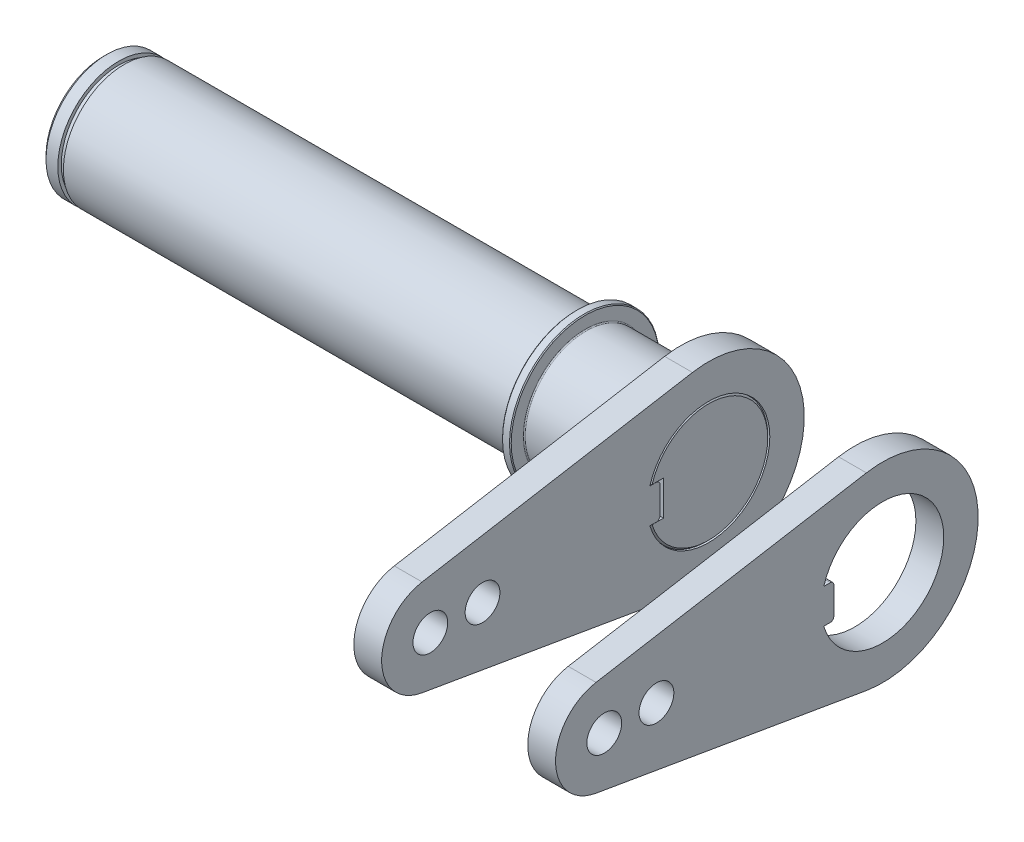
ISO-10303-21;
HEADER;
FILE_DESCRIPTION(('STEP AP214'),'2;1');
FILE_NAME('part.step','',(''),(''),'','','');
FILE_SCHEMA(('AUTOMOTIVE_DESIGN { 1 0 10303 214 1 1 1 1 }'));
ENDSEC;
DATA;
#1=APPLICATION_CONTEXT('core data for automotive mechanical design processes');
#2=APPLICATION_PROTOCOL_DEFINITION('international standard','automotive_design',2000,#1);
#3=PRODUCT_CONTEXT('',#1,'mechanical');
#4=PRODUCT('Part','Part','',(#3));
#5=PRODUCT_RELATED_PRODUCT_CATEGORY('part','',(#4));
#6=PRODUCT_DEFINITION_FORMATION('','',#4);
#7=PRODUCT_DEFINITION_CONTEXT('part definition',#1,'design');
#8=PRODUCT_DEFINITION('design','',#6,#7);
#9=PRODUCT_DEFINITION_SHAPE('','',#8);
#10=(LENGTH_UNIT() NAMED_UNIT(*) SI_UNIT(.MILLI.,.METRE.));
#11=(NAMED_UNIT(*) PLANE_ANGLE_UNIT() SI_UNIT($,.RADIAN.));
#12=(NAMED_UNIT(*) SI_UNIT($,.STERADIAN.) SOLID_ANGLE_UNIT());
#13=UNCERTAINTY_MEASURE_WITH_UNIT(LENGTH_MEASURE(1.E-05),#10,'distance_accuracy_value','');
#14=(GEOMETRIC_REPRESENTATION_CONTEXT(3) GLOBAL_UNCERTAINTY_ASSIGNED_CONTEXT((#13)) GLOBAL_UNIT_ASSIGNED_CONTEXT((#10,
#11,#12)) REPRESENTATION_CONTEXT('',''));
#15=CARTESIAN_POINT('',(0.,0.,0.));
#16=DIRECTION('',(0.,0.,1.));
#17=DIRECTION('',(1.,0.,0.));
#18=AXIS2_PLACEMENT_3D('',#15,#16,#17);
#19=CARTESIAN_POINT('',(76.5,0.,0.));
#20=DIRECTION('',(1.,0.,0.));
#21=DIRECTION('',(0.,1.,0.));
#22=AXIS2_PLACEMENT_3D('',#19,#20,#21);
#23=CYLINDRICAL_SURFACE('',#22,27.5);
#24=CARTESIAN_POINT('',(84.5,0.,0.));
#25=DIRECTION('',(1.,0.,0.));
#26=DIRECTION('',(0.,1.,0.));
#27=AXIS2_PLACEMENT_3D('',#24,#25,#26);
#28=CIRCLE('',#27,27.5);
#29=CARTESIAN_POINT('',(84.5,-27.1056193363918,4.640625));
#30=VERTEX_POINT('',#29);
#31=CARTESIAN_POINT('',(84.5,27.1056193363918,4.640625));
#32=VERTEX_POINT('',#31);
#33=EDGE_CURVE('E171',#30,#32,#28,.T.);
#34=ORIENTED_EDGE('',*,*,#33,.F.);
#35=DIRECTION('',(1.,0.,0.));
#36=VECTOR('',#35,1.);
#37=CARTESIAN_POINT('',(76.5,-27.1056193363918,4.640625));
#38=LINE('',#37,#36);
#39=CARTESIAN_POINT('',(76.5,-27.1056193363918,4.640625));
#40=VERTEX_POINT('',#39);
#41=EDGE_CURVE('E12',#40,#30,#38,.T.);
#42=ORIENTED_EDGE('',*,*,#41,.F.);
#43=CARTESIAN_POINT('',(76.5,0.,0.));
#44=DIRECTION('',(1.,0.,0.));
#45=DIRECTION('',(0.,1.,0.));
#46=AXIS2_PLACEMENT_3D('',#43,#44,#45);
#47=CIRCLE('',#46,27.5);
#48=CARTESIAN_POINT('',(76.5,27.1056193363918,4.640625));
#49=VERTEX_POINT('',#48);
#50=EDGE_CURVE('E179',#40,#49,#47,.T.);
#51=ORIENTED_EDGE('',*,*,#50,.T.);
#52=DIRECTION('',(1.,0.,0.));
#53=VECTOR('',#52,1.);
#54=CARTESIAN_POINT('',(76.5,27.1056193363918,4.640625));
#55=LINE('',#54,#53);
#56=EDGE_CURVE('E48',#49,#32,#55,.T.);
#57=ORIENTED_EDGE('',*,*,#56,.T.);
#58=EDGE_LOOP('',(#34,#42,#51,#57));
#59=FACE_BOUND('',#58,.T.);
#60=ADVANCED_FACE('F45',(#59),#23,.T.);
#61=CARTESIAN_POINT('',(76.5,-13.7992243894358,82.3625));
#62=DIRECTION('',(0.,-0.985658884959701,0.16875));
#63=DIRECTION('',(0.,-0.16875,-0.985658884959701));
#64=AXIS2_PLACEMENT_3D('',#61,#62,#63);
#65=PLANE('',#64);
#66=DIRECTION('',(0.,-0.16875,-0.9856588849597));
#67=VECTOR('',#66,1.);
#68=CARTESIAN_POINT('',(84.5,-13.7992243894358,82.3625));
#69=LINE('',#68,#67);
#70=CARTESIAN_POINT('',(84.5,-13.7992243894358,82.3625));
#71=VERTEX_POINT('',#70);
#72=EDGE_CURVE('E183',#71,#30,#69,.T.);
#73=ORIENTED_EDGE('',*,*,#72,.F.);
#74=DIRECTION('',(1.,0.,0.));
#75=VECTOR('',#74,1.);
#76=CARTESIAN_POINT('',(76.5,-13.7992243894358,82.3625));
#77=LINE('',#76,#75);
#78=CARTESIAN_POINT('',(76.5,-13.7992243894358,82.3625));
#79=VERTEX_POINT('',#78);
#80=EDGE_CURVE('E53',#79,#71,#77,.T.);
#81=ORIENTED_EDGE('',*,*,#80,.F.);
#82=DIRECTION('',(0.,-0.16875,-0.9856588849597));
#83=VECTOR('',#82,1.);
#84=CARTESIAN_POINT('',(76.5,-13.7992243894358,82.3625));
#85=LINE('',#84,#83);
#86=EDGE_CURVE('E189',#79,#40,#85,.T.);
#87=ORIENTED_EDGE('',*,*,#86,.T.);
#88=ORIENTED_EDGE('',*,*,#41,.T.);
#89=EDGE_LOOP('',(#73,#81,#87,#88));
#90=FACE_BOUND('',#89,.T.);
#91=ADVANCED_FACE('F215',(#90),#65,.T.);
#92=CARTESIAN_POINT('',(76.5,0.,80.));
#93=DIRECTION('',(1.,0.,0.));
#94=DIRECTION('',(0.,1.,0.));
#95=AXIS2_PLACEMENT_3D('',#92,#93,#94);
#96=CYLINDRICAL_SURFACE('',#95,14.);
#97=CARTESIAN_POINT('',(84.5,0.,80.));
#98=DIRECTION('',(1.,0.,0.));
#99=DIRECTION('',(0.,1.,0.));
#100=AXIS2_PLACEMENT_3D('',#97,#98,#99);
#101=CIRCLE('',#100,14.);
#102=CARTESIAN_POINT('',(84.5,13.7992243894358,82.3625));
#103=VERTEX_POINT('',#102);
#104=EDGE_CURVE('E197',#103,#71,#101,.T.);
#105=ORIENTED_EDGE('',*,*,#104,.F.);
#106=DIRECTION('',(1.,0.,0.));
#107=VECTOR('',#106,1.);
#108=CARTESIAN_POINT('',(76.5,13.7992243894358,82.3625));
#109=LINE('',#108,#107);
#110=CARTESIAN_POINT('',(76.5,13.7992243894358,82.3625));
#111=VERTEX_POINT('',#110);
#112=EDGE_CURVE('E202',#111,#103,#109,.T.);
#113=ORIENTED_EDGE('',*,*,#112,.F.);
#114=CARTESIAN_POINT('',(76.5,0.,80.));
#115=DIRECTION('',(1.,0.,0.));
#116=DIRECTION('',(0.,1.,0.));
#117=AXIS2_PLACEMENT_3D('',#114,#115,#116);
#118=CIRCLE('',#117,14.);
#119=EDGE_CURVE('E186',#111,#79,#118,.T.);
#120=ORIENTED_EDGE('',*,*,#119,.T.);
#121=ORIENTED_EDGE('',*,*,#80,.T.);
#122=EDGE_LOOP('',(#105,#113,#120,#121));
#123=FACE_BOUND('',#122,.T.);
#124=ADVANCED_FACE('F219',(#123),#96,.T.);
#125=CARTESIAN_POINT('',(76.5,27.1056193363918,4.640625));
#126=DIRECTION('',(0.,0.985658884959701,0.16875));
#127=DIRECTION('',(0.,-0.16875,0.985658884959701));
#128=AXIS2_PLACEMENT_3D('',#125,#126,#127);
#129=PLANE('',#128);
#130=DIRECTION('',(0.,-0.16875,0.9856588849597));
#131=VECTOR('',#130,1.);
#132=CARTESIAN_POINT('',(84.5,27.1056193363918,4.640625));
#133=LINE('',#132,#131);
#134=EDGE_CURVE('E194',#32,#103,#133,.T.);
#135=ORIENTED_EDGE('',*,*,#134,.F.);
#136=ORIENTED_EDGE('',*,*,#56,.F.);
#137=DIRECTION('',(0.,-0.16875,0.9856588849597));
#138=VECTOR('',#137,1.);
#139=CARTESIAN_POINT('',(76.5,27.1056193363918,4.640625));
#140=LINE('',#139,#138);
#141=EDGE_CURVE('E182',#49,#111,#140,.T.);
#142=ORIENTED_EDGE('',*,*,#141,.T.);
#143=ORIENTED_EDGE('',*,*,#112,.T.);
#144=EDGE_LOOP('',(#135,#136,#142,#143));
#145=FACE_BOUND('',#144,.T.);
#146=ADVANCED_FACE('F210',(#145),#129,.T.);
#147=CARTESIAN_POINT('',(76.5,0.,0.));
#148=DIRECTION('',(1.,0.,0.));
#149=DIRECTION('',(0.,1.,0.));
#150=AXIS2_PLACEMENT_3D('',#147,#148,#149);
#151=PLANE('',#150);
#152=CARTESIAN_POINT('',(76.5,0.,65.));
#153=DIRECTION('',(1.,0.,0.));
#154=DIRECTION('',(0.,1.,0.));
#155=AXIS2_PLACEMENT_3D('',#152,#153,#154);
#156=CIRCLE('',#155,5.);
#157=CARTESIAN_POINT('',(76.5,5.,65.));
#158=VERTEX_POINT('',#157);
#159=EDGE_CURVE('E344',#158,#158,#156,.T.);
#160=ORIENTED_EDGE('',*,*,#159,.T.);
#161=EDGE_LOOP('',(#160));
#162=FACE_BOUND('',#161,.T.);
#163=CARTESIAN_POINT('',(76.5,0.,80.));
#164=DIRECTION('',(1.,0.,0.));
#165=DIRECTION('',(0.,1.,0.));
#166=AXIS2_PLACEMENT_3D('',#163,#164,#165);
#167=CIRCLE('',#166,5.);
#168=CARTESIAN_POINT('',(76.5,5.,80.));
#169=VERTEX_POINT('',#168);
#170=EDGE_CURVE('E159',#169,#169,#167,.T.);
#171=ORIENTED_EDGE('',*,*,#170,.T.);
#172=EDGE_LOOP('',(#171));
#173=FACE_BOUND('',#172,.T.);
#174=DIRECTION('',(0.,-1.,0.));
#175=VECTOR('',#174,1.);
#176=CARTESIAN_POINT('',(76.5,3.95,14.));
#177=LINE('',#176,#175);
#178=CARTESIAN_POINT('',(76.5,3.95,14.));
#179=VERTEX_POINT('',#178);
#180=CARTESIAN_POINT('',(76.5,-3.95,14.));
#181=VERTEX_POINT('',#180);
#182=EDGE_CURVE('E130',#179,#181,#177,.T.);
#183=ORIENTED_EDGE('',*,*,#182,.T.);
#184=CARTESIAN_POINT('',(76.5,-3.95,15.));
#185=DIRECTION('',(-1.,0.,0.));
#186=DIRECTION('',(0.,-1.,0.));
#187=AXIS2_PLACEMENT_3D('',#184,#185,#186);
#188=CIRCLE('',#187,1.);
#189=CARTESIAN_POINT('',(76.5,-4.95,15.));
#190=VERTEX_POINT('',#189);
#191=EDGE_CURVE('E124',#181,#190,#188,.T.);
#192=ORIENTED_EDGE('',*,*,#191,.T.);
#193=DIRECTION('',(0.,0.,1.));
#194=VECTOR('',#193,1.);
#195=CARTESIAN_POINT('',(76.5,-4.95,15.));
#196=LINE('',#195,#194);
#197=CARTESIAN_POINT('',(76.5,-4.95,16.8895677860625));
#198=VERTEX_POINT('',#197);
#199=EDGE_CURVE('E133',#190,#198,#196,.T.);
#200=ORIENTED_EDGE('',*,*,#199,.T.);
#201=CARTESIAN_POINT('',(76.5,0.,0.));
#202=DIRECTION('',(1.,0.,0.));
#203=DIRECTION('',(0.,1.,0.));
#204=AXIS2_PLACEMENT_3D('',#201,#202,#203);
#205=CIRCLE('',#204,17.6);
#206=CARTESIAN_POINT('',(76.5,4.95,16.8895677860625));
#207=VERTEX_POINT('',#206);
#208=EDGE_CURVE('E61',#198,#207,#205,.T.);
#209=ORIENTED_EDGE('',*,*,#208,.T.);
#210=DIRECTION('',(0.,0.,-1.));
#211=VECTOR('',#210,1.);
#212=CARTESIAN_POINT('',(76.5,4.95,16.8895677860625));
#213=LINE('',#212,#211);
#214=CARTESIAN_POINT('',(76.5,4.95,15.));
#215=VERTEX_POINT('',#214);
#216=EDGE_CURVE('E151',#207,#215,#213,.T.);
#217=ORIENTED_EDGE('',*,*,#216,.T.);
#218=CARTESIAN_POINT('',(76.5,3.95,15.));
#219=DIRECTION('',(-1.,0.,0.));
#220=DIRECTION('',(0.,-1.,0.));
#221=AXIS2_PLACEMENT_3D('',#218,#219,#220);
#222=CIRCLE('',#221,1.);
#223=EDGE_CURVE('E154',#215,#179,#222,.T.);
#224=ORIENTED_EDGE('',*,*,#223,.T.);
#225=EDGE_LOOP('',(#183,#192,#200,#209,#217,#224));
#226=FACE_BOUND('',#225,.T.);
#227=ORIENTED_EDGE('',*,*,#50,.F.);
#228=ORIENTED_EDGE('',*,*,#86,.F.);
#229=ORIENTED_EDGE('',*,*,#119,.F.);
#230=ORIENTED_EDGE('',*,*,#141,.F.);
#231=EDGE_LOOP('',(#227,#228,#229,#230));
#232=FACE_BOUND('',#231,.T.);
#233=ADVANCED_FACE('F137',(#162,#173,#226,#232),#151,.F.);
#234=CARTESIAN_POINT('',(84.5,0.,0.));
#235=DIRECTION('',(1.,0.,0.));
#236=DIRECTION('',(0.,1.,0.));
#237=AXIS2_PLACEMENT_3D('',#234,#235,#236);
#238=PLANE('',#237);
#239=CARTESIAN_POINT('',(84.5,0.,65.));
#240=DIRECTION('',(1.,0.,0.));
#241=DIRECTION('',(0.,1.,0.));
#242=AXIS2_PLACEMENT_3D('',#239,#240,#241);
#243=CIRCLE('',#242,5.);
#244=CARTESIAN_POINT('',(84.5,5.,65.));
#245=VERTEX_POINT('',#244);
#246=EDGE_CURVE('E347',#245,#245,#243,.T.);
#247=ORIENTED_EDGE('',*,*,#246,.F.);
#248=EDGE_LOOP('',(#247));
#249=FACE_BOUND('',#248,.T.);
#250=CARTESIAN_POINT('',(84.5,0.,80.));
#251=DIRECTION('',(1.,0.,0.));
#252=DIRECTION('',(0.,1.,0.));
#253=AXIS2_PLACEMENT_3D('',#250,#251,#252);
#254=CIRCLE('',#253,5.);
#255=CARTESIAN_POINT('',(84.5,5.,80.));
#256=VERTEX_POINT('',#255);
#257=EDGE_CURVE('E147',#256,#256,#254,.T.);
#258=ORIENTED_EDGE('',*,*,#257,.F.);
#259=EDGE_LOOP('',(#258));
#260=FACE_BOUND('',#259,.T.);
#261=CARTESIAN_POINT('',(84.5,-3.95,15.));
#262=DIRECTION('',(-1.,0.,0.));
#263=DIRECTION('',(0.,-1.,0.));
#264=AXIS2_PLACEMENT_3D('',#261,#262,#263);
#265=CIRCLE('',#264,1.);
#266=CARTESIAN_POINT('',(84.5,-3.95,14.));
#267=VERTEX_POINT('',#266);
#268=CARTESIAN_POINT('',(84.5,-4.95,15.));
#269=VERTEX_POINT('',#268);
#270=EDGE_CURVE('E69',#267,#269,#265,.T.);
#271=ORIENTED_EDGE('',*,*,#270,.F.);
#272=DIRECTION('',(0.,-1.,0.));
#273=VECTOR('',#272,1.);
#274=CARTESIAN_POINT('',(84.5,3.95,14.));
#275=LINE('',#274,#273);
#276=CARTESIAN_POINT('',(84.5,3.95,14.));
#277=VERTEX_POINT('',#276);
#278=EDGE_CURVE('E141',#277,#267,#275,.T.);
#279=ORIENTED_EDGE('',*,*,#278,.F.);
#280=CARTESIAN_POINT('',(84.5,3.95,15.));
#281=DIRECTION('',(-1.,0.,0.));
#282=DIRECTION('',(0.,-1.,0.));
#283=AXIS2_PLACEMENT_3D('',#280,#281,#282);
#284=CIRCLE('',#283,1.);
#285=CARTESIAN_POINT('',(84.5,4.95,15.));
#286=VERTEX_POINT('',#285);
#287=EDGE_CURVE('E144',#286,#277,#284,.T.);
#288=ORIENTED_EDGE('',*,*,#287,.F.);
#289=DIRECTION('',(0.,0.,-1.));
#290=VECTOR('',#289,1.);
#291=CARTESIAN_POINT('',(84.5,4.95,16.8895677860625));
#292=LINE('',#291,#290);
#293=CARTESIAN_POINT('',(84.5,4.95,16.8895677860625));
#294=VERTEX_POINT('',#293);
#295=EDGE_CURVE('E164',#294,#286,#292,.T.);
#296=ORIENTED_EDGE('',*,*,#295,.F.);
#297=CARTESIAN_POINT('',(84.5,0.,0.));
#298=DIRECTION('',(1.,0.,0.));
#299=DIRECTION('',(0.,1.,0.));
#300=AXIS2_PLACEMENT_3D('',#297,#298,#299);
#301=CIRCLE('',#300,17.6);
#302=CARTESIAN_POINT('',(84.5,-4.95,16.8895677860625));
#303=VERTEX_POINT('',#302);
#304=EDGE_CURVE('E161',#303,#294,#301,.T.);
#305=ORIENTED_EDGE('',*,*,#304,.F.);
#306=DIRECTION('',(0.,0.,1.));
#307=VECTOR('',#306,1.);
#308=CARTESIAN_POINT('',(84.5,-4.95,15.));
#309=LINE('',#308,#307);
#310=EDGE_CURVE('E158',#269,#303,#309,.T.);
#311=ORIENTED_EDGE('',*,*,#310,.F.);
#312=EDGE_LOOP('',(#271,#279,#288,#296,#305,#311));
#313=FACE_BOUND('',#312,.T.);
#314=ORIENTED_EDGE('',*,*,#33,.T.);
#315=ORIENTED_EDGE('',*,*,#134,.T.);
#316=ORIENTED_EDGE('',*,*,#104,.T.);
#317=ORIENTED_EDGE('',*,*,#72,.T.);
#318=EDGE_LOOP('',(#314,#315,#316,#317));
#319=FACE_BOUND('',#318,.T.);
#320=ADVANCED_FACE('F212',(#249,#260,#313,#319),#238,.T.);
#321=CARTESIAN_POINT('',(76.5,-3.95,15.));
#322=DIRECTION('',(1.,0.,0.));
#323=DIRECTION('',(0.,1.,0.));
#324=AXIS2_PLACEMENT_3D('',#321,#322,#323);
#325=CYLINDRICAL_SURFACE('',#324,1.);
#326=ORIENTED_EDGE('',*,*,#270,.T.);
#327=DIRECTION('',(1.,0.,0.));
#328=VECTOR('',#327,1.);
#329=CARTESIAN_POINT('',(76.5,-4.95,15.));
#330=LINE('',#329,#328);
#331=EDGE_CURVE('E120',#190,#269,#330,.T.);
#332=ORIENTED_EDGE('',*,*,#331,.F.);
#333=ORIENTED_EDGE('',*,*,#191,.F.);
#334=DIRECTION('',(1.,0.,0.));
#335=VECTOR('',#334,1.);
#336=CARTESIAN_POINT('',(76.5,-3.95,14.));
#337=LINE('',#336,#335);
#338=EDGE_CURVE('E169',#181,#267,#337,.T.);
#339=ORIENTED_EDGE('',*,*,#338,.T.);
#340=EDGE_LOOP('',(#326,#332,#333,#339));
#341=FACE_BOUND('',#340,.T.);
#342=ADVANCED_FACE('F122',(#341),#325,.T.);
#343=CARTESIAN_POINT('',(76.5,3.95,14.));
#344=DIRECTION('',(0.,0.,1.));
#345=DIRECTION('',(1.,0.,0.));
#346=AXIS2_PLACEMENT_3D('',#343,#344,#345);
#347=PLANE('',#346);
#348=ORIENTED_EDGE('',*,*,#278,.T.);
#349=ORIENTED_EDGE('',*,*,#338,.F.);
#350=ORIENTED_EDGE('',*,*,#182,.F.);
#351=DIRECTION('',(1.,0.,0.));
#352=VECTOR('',#351,1.);
#353=CARTESIAN_POINT('',(76.5,3.95,14.));
#354=LINE('',#353,#352);
#355=EDGE_CURVE('E172',#179,#277,#354,.T.);
#356=ORIENTED_EDGE('',*,*,#355,.T.);
#357=EDGE_LOOP('',(#348,#349,#350,#356));
#358=FACE_BOUND('',#357,.T.);
#359=ADVANCED_FACE('F271',(#358),#347,.F.);
#360=CARTESIAN_POINT('',(76.5,3.95,15.));
#361=DIRECTION('',(1.,0.,0.));
#362=DIRECTION('',(0.,1.,0.));
#363=AXIS2_PLACEMENT_3D('',#360,#361,#362);
#364=CYLINDRICAL_SURFACE('',#363,1.);
#365=ORIENTED_EDGE('',*,*,#287,.T.);
#366=ORIENTED_EDGE('',*,*,#355,.F.);
#367=ORIENTED_EDGE('',*,*,#223,.F.);
#368=DIRECTION('',(1.,0.,0.));
#369=VECTOR('',#368,1.);
#370=CARTESIAN_POINT('',(76.5,4.95,15.));
#371=LINE('',#370,#369);
#372=EDGE_CURVE('E174',#215,#286,#371,.T.);
#373=ORIENTED_EDGE('',*,*,#372,.T.);
#374=EDGE_LOOP('',(#365,#366,#367,#373));
#375=FACE_BOUND('',#374,.T.);
#376=ADVANCED_FACE('F280',(#375),#364,.T.);
#377=CARTESIAN_POINT('',(76.5,4.95,16.8895677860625));
#378=DIRECTION('',(0.,-1.,0.));
#379=DIRECTION('',(1.,0.,0.));
#380=AXIS2_PLACEMENT_3D('',#377,#378,#379);
#381=PLANE('',#380);
#382=ORIENTED_EDGE('',*,*,#295,.T.);
#383=ORIENTED_EDGE('',*,*,#372,.F.);
#384=ORIENTED_EDGE('',*,*,#216,.F.);
#385=DIRECTION('',(1.,0.,0.));
#386=VECTOR('',#385,1.);
#387=CARTESIAN_POINT('',(76.5,4.95,16.8895677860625));
#388=LINE('',#387,#386);
#389=EDGE_CURVE('E176',#207,#294,#388,.T.);
#390=ORIENTED_EDGE('',*,*,#389,.T.);
#391=EDGE_LOOP('',(#382,#383,#384,#390));
#392=FACE_BOUND('',#391,.T.);
#393=ADVANCED_FACE('F290',(#392),#381,.F.);
#394=CARTESIAN_POINT('',(76.5,0.,0.));
#395=DIRECTION('',(1.,0.,0.));
#396=DIRECTION('',(0.,1.,0.));
#397=AXIS2_PLACEMENT_3D('',#394,#395,#396);
#398=CYLINDRICAL_SURFACE('',#397,17.6);
#399=ORIENTED_EDGE('',*,*,#304,.T.);
#400=ORIENTED_EDGE('',*,*,#389,.F.);
#401=ORIENTED_EDGE('',*,*,#208,.F.);
#402=DIRECTION('',(1.,0.,0.));
#403=VECTOR('',#402,1.);
#404=CARTESIAN_POINT('',(76.5,-4.95,16.8895677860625));
#405=LINE('',#404,#403);
#406=EDGE_CURVE('E129',#198,#303,#405,.T.);
#407=ORIENTED_EDGE('',*,*,#406,.T.);
#408=EDGE_LOOP('',(#399,#400,#401,#407));
#409=FACE_BOUND('',#408,.T.);
#410=ADVANCED_FACE('F300',(#409),#398,.F.);
#411=CARTESIAN_POINT('',(76.5,-4.95,15.));
#412=DIRECTION('',(0.,1.,0.));
#413=DIRECTION('',(-1.,0.,0.));
#414=AXIS2_PLACEMENT_3D('',#411,#412,#413);
#415=PLANE('',#414);
#416=ORIENTED_EDGE('',*,*,#310,.T.);
#417=ORIENTED_EDGE('',*,*,#406,.F.);
#418=ORIENTED_EDGE('',*,*,#199,.F.);
#419=ORIENTED_EDGE('',*,*,#331,.T.);
#420=EDGE_LOOP('',(#416,#417,#418,#419));
#421=FACE_BOUND('',#420,.T.);
#422=ADVANCED_FACE('F134',(#421),#415,.F.);
#423=CARTESIAN_POINT('',(76.5,0.,80.));
#424=DIRECTION('',(1.,0.,0.));
#425=DIRECTION('',(0.,1.,0.));
#426=AXIS2_PLACEMENT_3D('',#423,#424,#425);
#427=CYLINDRICAL_SURFACE('',#426,5.);
#428=ORIENTED_EDGE('',*,*,#170,.F.);
#429=EDGE_LOOP('',(#428));
#430=FACE_BOUND('',#429,.T.);
#431=ORIENTED_EDGE('',*,*,#257,.T.);
#432=EDGE_LOOP('',(#431));
#433=FACE_BOUND('',#432,.T.);
#434=ADVANCED_FACE('F318',(#430,#433),#427,.F.);
#435=CARTESIAN_POINT('',(76.5,0.,65.));
#436=DIRECTION('',(1.,0.,0.));
#437=DIRECTION('',(0.,1.,0.));
#438=AXIS2_PLACEMENT_3D('',#435,#436,#437);
#439=CYLINDRICAL_SURFACE('',#438,5.);
#440=ORIENTED_EDGE('',*,*,#159,.F.);
#441=EDGE_LOOP('',(#440));
#442=FACE_BOUND('',#441,.T.);
#443=ORIENTED_EDGE('',*,*,#246,.T.);
#444=EDGE_LOOP('',(#443));
#445=FACE_BOUND('',#444,.T.);
#446=ADVANCED_FACE('F327',(#442,#445),#439,.F.);
#447=CLOSED_SHELL('',(#60,#91,#124,#146,#233,#320,#342,#359,#376,#393,#410,#422,#434,#446));
#448=MANIFOLD_SOLID_BREP('B2_NOT_SHOWN',#447);
#449=CARTESIAN_POINT('',(26.5,0.,0.));
#450=DIRECTION('',(1.,0.,0.));
#451=DIRECTION('',(0.,1.,0.));
#452=AXIS2_PLACEMENT_3D('',#449,#450,#451);
#453=CYLINDRICAL_SURFACE('',#452,27.5);
#454=CARTESIAN_POINT('',(34.5,0.,0.));
#455=DIRECTION('',(1.,0.,0.));
#456=DIRECTION('',(0.,1.,0.));
#457=AXIS2_PLACEMENT_3D('',#454,#455,#456);
#458=CIRCLE('',#457,27.5);
#459=CARTESIAN_POINT('',(34.5,-27.1056193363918,4.640625));
#460=VERTEX_POINT('',#459);
#461=CARTESIAN_POINT('',(34.5,27.1056193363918,4.640625));
#462=VERTEX_POINT('',#461);
#463=EDGE_CURVE('E503',#460,#462,#458,.T.);
#464=ORIENTED_EDGE('',*,*,#463,.F.);
#465=DIRECTION('',(1.,0.,0.));
#466=VECTOR('',#465,1.);
#467=CARTESIAN_POINT('',(26.5,-27.1056193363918,4.640625));
#468=LINE('',#467,#466);
#469=CARTESIAN_POINT('',(26.5,-27.1056193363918,4.640625));
#470=VERTEX_POINT('',#469);
#471=EDGE_CURVE('E43',#470,#460,#468,.T.);
#472=ORIENTED_EDGE('',*,*,#471,.F.);
#473=CARTESIAN_POINT('',(26.5,0.,0.));
#474=DIRECTION('',(1.,0.,0.));
#475=DIRECTION('',(0.,1.,0.));
#476=AXIS2_PLACEMENT_3D('',#473,#474,#475);
#477=CIRCLE('',#476,27.5);
#478=CARTESIAN_POINT('',(26.5,27.1056193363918,4.640625));
#479=VERTEX_POINT('',#478);
#480=EDGE_CURVE('E511',#470,#479,#477,.T.);
#481=ORIENTED_EDGE('',*,*,#480,.T.);
#482=DIRECTION('',(1.,0.,0.));
#483=VECTOR('',#482,1.);
#484=CARTESIAN_POINT('',(26.5,27.1056193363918,4.640625));
#485=LINE('',#484,#483);
#486=EDGE_CURVE('E380',#479,#462,#485,.T.);
#487=ORIENTED_EDGE('',*,*,#486,.T.);
#488=EDGE_LOOP('',(#464,#472,#481,#487));
#489=FACE_BOUND('',#488,.T.);
#490=ADVANCED_FACE('F377',(#489),#453,.T.);
#491=CARTESIAN_POINT('',(26.5,-13.7992243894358,82.3625));
#492=DIRECTION('',(0.,-0.985658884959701,0.16875));
#493=DIRECTION('',(0.,-0.16875,-0.985658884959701));
#494=AXIS2_PLACEMENT_3D('',#491,#492,#493);
#495=PLANE('',#494);
#496=DIRECTION('',(0.,-0.16875,-0.9856588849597));
#497=VECTOR('',#496,1.);
#498=CARTESIAN_POINT('',(34.5,-13.7992243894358,82.3625));
#499=LINE('',#498,#497);
#500=CARTESIAN_POINT('',(34.5,-13.7992243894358,82.3625));
#501=VERTEX_POINT('',#500);
#502=EDGE_CURVE('E515',#501,#460,#499,.T.);
#503=ORIENTED_EDGE('',*,*,#502,.F.);
#504=DIRECTION('',(1.,0.,0.));
#505=VECTOR('',#504,1.);
#506=CARTESIAN_POINT('',(26.5,-13.7992243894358,82.3625));
#507=LINE('',#506,#505);
#508=CARTESIAN_POINT('',(26.5,-13.7992243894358,82.3625));
#509=VERTEX_POINT('',#508);
#510=EDGE_CURVE('E385',#509,#501,#507,.T.);
#511=ORIENTED_EDGE('',*,*,#510,.F.);
#512=DIRECTION('',(0.,-0.16875,-0.9856588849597));
#513=VECTOR('',#512,1.);
#514=CARTESIAN_POINT('',(26.5,-13.7992243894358,82.3625));
#515=LINE('',#514,#513);
#516=EDGE_CURVE('E521',#509,#470,#515,.T.);
#517=ORIENTED_EDGE('',*,*,#516,.T.);
#518=ORIENTED_EDGE('',*,*,#471,.T.);
#519=EDGE_LOOP('',(#503,#511,#517,#518));
#520=FACE_BOUND('',#519,.T.);
#521=ADVANCED_FACE('F547',(#520),#495,.T.);
#522=CARTESIAN_POINT('',(26.5,0.,80.));
#523=DIRECTION('',(1.,0.,0.));
#524=DIRECTION('',(0.,1.,0.));
#525=AXIS2_PLACEMENT_3D('',#522,#523,#524);
#526=CYLINDRICAL_SURFACE('',#525,14.);
#527=CARTESIAN_POINT('',(34.5,0.,80.));
#528=DIRECTION('',(1.,0.,0.));
#529=DIRECTION('',(0.,1.,0.));
#530=AXIS2_PLACEMENT_3D('',#527,#528,#529);
#531=CIRCLE('',#530,14.);
#532=CARTESIAN_POINT('',(34.5,13.7992243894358,82.3625));
#533=VERTEX_POINT('',#532);
#534=EDGE_CURVE('E529',#533,#501,#531,.T.);
#535=ORIENTED_EDGE('',*,*,#534,.F.);
#536=DIRECTION('',(1.,0.,0.));
#537=VECTOR('',#536,1.);
#538=CARTESIAN_POINT('',(26.5,13.7992243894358,82.3625));
#539=LINE('',#538,#537);
#540=CARTESIAN_POINT('',(26.5,13.7992243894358,82.3625));
#541=VERTEX_POINT('',#540);
#542=EDGE_CURVE('E534',#541,#533,#539,.T.);
#543=ORIENTED_EDGE('',*,*,#542,.F.);
#544=CARTESIAN_POINT('',(26.5,0.,80.));
#545=DIRECTION('',(1.,0.,0.));
#546=DIRECTION('',(0.,1.,0.));
#547=AXIS2_PLACEMENT_3D('',#544,#545,#546);
#548=CIRCLE('',#547,14.);
#549=EDGE_CURVE('E518',#541,#509,#548,.T.);
#550=ORIENTED_EDGE('',*,*,#549,.T.);
#551=ORIENTED_EDGE('',*,*,#510,.T.);
#552=EDGE_LOOP('',(#535,#543,#550,#551));
#553=FACE_BOUND('',#552,.T.);
#554=ADVANCED_FACE('F551',(#553),#526,.T.);
#555=CARTESIAN_POINT('',(26.5,27.1056193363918,4.640625));
#556=DIRECTION('',(0.,0.985658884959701,0.16875));
#557=DIRECTION('',(0.,-0.16875,0.985658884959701));
#558=AXIS2_PLACEMENT_3D('',#555,#556,#557);
#559=PLANE('',#558);
#560=DIRECTION('',(0.,-0.16875,0.9856588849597));
#561=VECTOR('',#560,1.);
#562=CARTESIAN_POINT('',(34.5,27.1056193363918,4.640625));
#563=LINE('',#562,#561);
#564=EDGE_CURVE('E526',#462,#533,#563,.T.);
#565=ORIENTED_EDGE('',*,*,#564,.F.);
#566=ORIENTED_EDGE('',*,*,#486,.F.);
#567=DIRECTION('',(0.,-0.16875,0.9856588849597));
#568=VECTOR('',#567,1.);
#569=CARTESIAN_POINT('',(26.5,27.1056193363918,4.640625));
#570=LINE('',#569,#568);
#571=EDGE_CURVE('E514',#479,#541,#570,.T.);
#572=ORIENTED_EDGE('',*,*,#571,.T.);
#573=ORIENTED_EDGE('',*,*,#542,.T.);
#574=EDGE_LOOP('',(#565,#566,#572,#573));
#575=FACE_BOUND('',#574,.T.);
#576=ADVANCED_FACE('F542',(#575),#559,.T.);
#577=CARTESIAN_POINT('',(26.5,0.,0.));
#578=DIRECTION('',(1.,0.,0.));
#579=DIRECTION('',(0.,1.,0.));
#580=AXIS2_PLACEMENT_3D('',#577,#578,#579);
#581=PLANE('',#580);
#582=CARTESIAN_POINT('',(26.5,0.,65.));
#583=DIRECTION('',(1.,0.,0.));
#584=DIRECTION('',(0.,1.,0.));
#585=AXIS2_PLACEMENT_3D('',#582,#583,#584);
#586=CIRCLE('',#585,5.);
#587=CARTESIAN_POINT('',(26.5,5.,65.));
#588=VERTEX_POINT('',#587);
#589=EDGE_CURVE('E701',#588,#588,#586,.T.);
#590=ORIENTED_EDGE('',*,*,#589,.T.);
#591=EDGE_LOOP('',(#590));
#592=FACE_BOUND('',#591,.T.);
#593=CARTESIAN_POINT('',(26.5,0.,80.));
#594=DIRECTION('',(1.,0.,0.));
#595=DIRECTION('',(0.,1.,0.));
#596=AXIS2_PLACEMENT_3D('',#593,#594,#595);
#597=CIRCLE('',#596,5.);
#598=CARTESIAN_POINT('',(26.5,5.,80.));
#599=VERTEX_POINT('',#598);
#600=EDGE_CURVE('E491',#599,#599,#597,.T.);
#601=ORIENTED_EDGE('',*,*,#600,.T.);
#602=EDGE_LOOP('',(#601));
#603=FACE_BOUND('',#602,.T.);
#604=DIRECTION('',(0.,-1.,0.));
#605=VECTOR('',#604,1.);
#606=CARTESIAN_POINT('',(26.5,3.95,14.));
#607=LINE('',#606,#605);
#608=CARTESIAN_POINT('',(26.5,3.95,14.));
#609=VERTEX_POINT('',#608);
#610=CARTESIAN_POINT('',(26.5,-3.95,14.));
#611=VERTEX_POINT('',#610);
#612=EDGE_CURVE('E462',#609,#611,#607,.T.);
#613=ORIENTED_EDGE('',*,*,#612,.T.);
#614=CARTESIAN_POINT('',(26.5,-3.95,15.));
#615=DIRECTION('',(-1.,0.,0.));
#616=DIRECTION('',(0.,-1.,0.));
#617=AXIS2_PLACEMENT_3D('',#614,#615,#616);
#618=CIRCLE('',#617,1.);
#619=CARTESIAN_POINT('',(26.5,-4.95,15.));
#620=VERTEX_POINT('',#619);
#621=EDGE_CURVE('E456',#611,#620,#618,.T.);
#622=ORIENTED_EDGE('',*,*,#621,.T.);
#623=DIRECTION('',(0.,0.,1.));
#624=VECTOR('',#623,1.);
#625=CARTESIAN_POINT('',(26.5,-4.95,15.));
#626=LINE('',#625,#624);
#627=CARTESIAN_POINT('',(26.5,-4.95,16.8895677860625));
#628=VERTEX_POINT('',#627);
#629=EDGE_CURVE('E465',#620,#628,#626,.T.);
#630=ORIENTED_EDGE('',*,*,#629,.T.);
#631=CARTESIAN_POINT('',(26.5,0.,0.));
#632=DIRECTION('',(1.,0.,0.));
#633=DIRECTION('',(0.,1.,0.));
#634=AXIS2_PLACEMENT_3D('',#631,#632,#633);
#635=CIRCLE('',#634,17.6);
#636=CARTESIAN_POINT('',(26.5,4.95,16.8895677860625));
#637=VERTEX_POINT('',#636);
#638=EDGE_CURVE('E393',#628,#637,#635,.T.);
#639=ORIENTED_EDGE('',*,*,#638,.T.);
#640=DIRECTION('',(0.,0.,-1.));
#641=VECTOR('',#640,1.);
#642=CARTESIAN_POINT('',(26.5,4.95,16.8895677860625));
#643=LINE('',#642,#641);
#644=CARTESIAN_POINT('',(26.5,4.95,15.));
#645=VERTEX_POINT('',#644);
#646=EDGE_CURVE('E483',#637,#645,#643,.T.);
#647=ORIENTED_EDGE('',*,*,#646,.T.);
#648=CARTESIAN_POINT('',(26.5,3.95,15.));
#649=DIRECTION('',(-1.,0.,0.));
#650=DIRECTION('',(0.,-1.,0.));
#651=AXIS2_PLACEMENT_3D('',#648,#649,#650);
#652=CIRCLE('',#651,1.);
#653=EDGE_CURVE('E486',#645,#609,#652,.T.);
#654=ORIENTED_EDGE('',*,*,#653,.T.);
#655=EDGE_LOOP('',(#613,#622,#630,#639,#647,#654));
#656=FACE_BOUND('',#655,.T.);
#657=ORIENTED_EDGE('',*,*,#480,.F.);
#658=ORIENTED_EDGE('',*,*,#516,.F.);
#659=ORIENTED_EDGE('',*,*,#549,.F.);
#660=ORIENTED_EDGE('',*,*,#571,.F.);
#661=EDGE_LOOP('',(#657,#658,#659,#660));
#662=FACE_BOUND('',#661,.T.);
#663=ADVANCED_FACE('F469',(#592,#603,#656,#662),#581,.F.);
#664=CARTESIAN_POINT('',(34.5,0.,0.));
#665=DIRECTION('',(1.,0.,0.));
#666=DIRECTION('',(0.,1.,0.));
#667=AXIS2_PLACEMENT_3D('',#664,#665,#666);
#668=PLANE('',#667);
#669=CARTESIAN_POINT('',(34.5,0.,65.));
#670=DIRECTION('',(1.,0.,0.));
#671=DIRECTION('',(0.,1.,0.));
#672=AXIS2_PLACEMENT_3D('',#669,#670,#671);
#673=CIRCLE('',#672,5.);
#674=CARTESIAN_POINT('',(34.5,5.,65.));
#675=VERTEX_POINT('',#674);
#676=EDGE_CURVE('E697',#675,#675,#673,.T.);
#677=ORIENTED_EDGE('',*,*,#676,.F.);
#678=EDGE_LOOP('',(#677));
#679=FACE_BOUND('',#678,.T.);
#680=CARTESIAN_POINT('',(34.5,0.,80.));
#681=DIRECTION('',(1.,0.,0.));
#682=DIRECTION('',(0.,1.,0.));
#683=AXIS2_PLACEMENT_3D('',#680,#681,#682);
#684=CIRCLE('',#683,5.);
#685=CARTESIAN_POINT('',(34.5,5.,80.));
#686=VERTEX_POINT('',#685);
#687=EDGE_CURVE('E479',#686,#686,#684,.T.);
#688=ORIENTED_EDGE('',*,*,#687,.F.);
#689=EDGE_LOOP('',(#688));
#690=FACE_BOUND('',#689,.T.);
#691=CARTESIAN_POINT('',(34.5,-3.95,15.));
#692=DIRECTION('',(-1.,0.,0.));
#693=DIRECTION('',(0.,-1.,0.));
#694=AXIS2_PLACEMENT_3D('',#691,#692,#693);
#695=CIRCLE('',#694,1.);
#696=CARTESIAN_POINT('',(34.5,-3.95,14.));
#697=VERTEX_POINT('',#696);
#698=CARTESIAN_POINT('',(34.5,-4.95,15.));
#699=VERTEX_POINT('',#698);
#700=EDGE_CURVE('E401',#697,#699,#695,.T.);
#701=ORIENTED_EDGE('',*,*,#700,.F.);
#702=DIRECTION('',(0.,-1.,0.));
#703=VECTOR('',#702,1.);
#704=CARTESIAN_POINT('',(34.5,3.95,14.));
#705=LINE('',#704,#703);
#706=CARTESIAN_POINT('',(34.5,3.95,14.));
#707=VERTEX_POINT('',#706);
#708=EDGE_CURVE('E473',#707,#697,#705,.T.);
#709=ORIENTED_EDGE('',*,*,#708,.F.);
#710=CARTESIAN_POINT('',(34.5,3.95,15.));
#711=DIRECTION('',(-1.,0.,0.));
#712=DIRECTION('',(0.,-1.,0.));
#713=AXIS2_PLACEMENT_3D('',#710,#711,#712);
#714=CIRCLE('',#713,1.);
#715=CARTESIAN_POINT('',(34.5,4.95,15.));
#716=VERTEX_POINT('',#715);
#717=EDGE_CURVE('E476',#716,#707,#714,.T.);
#718=ORIENTED_EDGE('',*,*,#717,.F.);
#719=DIRECTION('',(0.,0.,-1.));
#720=VECTOR('',#719,1.);
#721=CARTESIAN_POINT('',(34.5,4.95,16.8895677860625));
#722=LINE('',#721,#720);
#723=CARTESIAN_POINT('',(34.5,4.95,16.8895677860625));
#724=VERTEX_POINT('',#723);
#725=EDGE_CURVE('E496',#724,#716,#722,.T.);
#726=ORIENTED_EDGE('',*,*,#725,.F.);
#727=CARTESIAN_POINT('',(34.5,0.,0.));
#728=DIRECTION('',(1.,0.,0.));
#729=DIRECTION('',(0.,1.,0.));
#730=AXIS2_PLACEMENT_3D('',#727,#728,#729);
#731=CIRCLE('',#730,17.6);
#732=CARTESIAN_POINT('',(34.5,-4.95,16.8895677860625));
#733=VERTEX_POINT('',#732);
#734=EDGE_CURVE('E493',#733,#724,#731,.T.);
#735=ORIENTED_EDGE('',*,*,#734,.F.);
#736=DIRECTION('',(0.,0.,1.));
#737=VECTOR('',#736,1.);
#738=CARTESIAN_POINT('',(34.5,-4.95,15.));
#739=LINE('',#738,#737);
#740=EDGE_CURVE('E490',#699,#733,#739,.T.);
#741=ORIENTED_EDGE('',*,*,#740,.F.);
#742=EDGE_LOOP('',(#701,#709,#718,#726,#735,#741));
#743=FACE_BOUND('',#742,.T.);
#744=ORIENTED_EDGE('',*,*,#463,.T.);
#745=ORIENTED_EDGE('',*,*,#564,.T.);
#746=ORIENTED_EDGE('',*,*,#534,.T.);
#747=ORIENTED_EDGE('',*,*,#502,.T.);
#748=EDGE_LOOP('',(#744,#745,#746,#747));
#749=FACE_BOUND('',#748,.T.);
#750=ADVANCED_FACE('F544',(#679,#690,#743,#749),#668,.T.);
#751=CARTESIAN_POINT('',(26.5,-3.95,15.));
#752=DIRECTION('',(1.,0.,0.));
#753=DIRECTION('',(0.,1.,0.));
#754=AXIS2_PLACEMENT_3D('',#751,#752,#753);
#755=CYLINDRICAL_SURFACE('',#754,1.);
#756=ORIENTED_EDGE('',*,*,#700,.T.);
#757=DIRECTION('',(1.,0.,0.));
#758=VECTOR('',#757,1.);
#759=CARTESIAN_POINT('',(26.5,-4.95,15.));
#760=LINE('',#759,#758);
#761=EDGE_CURVE('E452',#620,#699,#760,.T.);
#762=ORIENTED_EDGE('',*,*,#761,.F.);
#763=ORIENTED_EDGE('',*,*,#621,.F.);
#764=DIRECTION('',(1.,0.,0.));
#765=VECTOR('',#764,1.);
#766=CARTESIAN_POINT('',(26.5,-3.95,14.));
#767=LINE('',#766,#765);
#768=EDGE_CURVE('E501',#611,#697,#767,.T.);
#769=ORIENTED_EDGE('',*,*,#768,.T.);
#770=EDGE_LOOP('',(#756,#762,#763,#769));
#771=FACE_BOUND('',#770,.T.);
#772=ADVANCED_FACE('F454',(#771),#755,.T.);
#773=CARTESIAN_POINT('',(26.5,3.95,14.));
#774=DIRECTION('',(0.,0.,1.));
#775=DIRECTION('',(1.,0.,0.));
#776=AXIS2_PLACEMENT_3D('',#773,#774,#775);
#777=PLANE('',#776);
#778=ORIENTED_EDGE('',*,*,#708,.T.);
#779=ORIENTED_EDGE('',*,*,#768,.F.);
#780=ORIENTED_EDGE('',*,*,#612,.F.);
#781=DIRECTION('',(1.,0.,0.));
#782=VECTOR('',#781,1.);
#783=CARTESIAN_POINT('',(26.5,3.95,14.));
#784=LINE('',#783,#782);
#785=EDGE_CURVE('E504',#609,#707,#784,.T.);
#786=ORIENTED_EDGE('',*,*,#785,.T.);
#787=EDGE_LOOP('',(#778,#779,#780,#786));
#788=FACE_BOUND('',#787,.T.);
#789=ADVANCED_FACE('F632',(#788),#777,.F.);
#790=CARTESIAN_POINT('',(26.5,3.95,15.));
#791=DIRECTION('',(1.,0.,0.));
#792=DIRECTION('',(0.,1.,0.));
#793=AXIS2_PLACEMENT_3D('',#790,#791,#792);
#794=CYLINDRICAL_SURFACE('',#793,1.);
#795=ORIENTED_EDGE('',*,*,#717,.T.);
#796=ORIENTED_EDGE('',*,*,#785,.F.);
#797=ORIENTED_EDGE('',*,*,#653,.F.);
#798=DIRECTION('',(1.,0.,0.));
#799=VECTOR('',#798,1.);
#800=CARTESIAN_POINT('',(26.5,4.95,15.));
#801=LINE('',#800,#799);
#802=EDGE_CURVE('E506',#645,#716,#801,.T.);
#803=ORIENTED_EDGE('',*,*,#802,.T.);
#804=EDGE_LOOP('',(#795,#796,#797,#803));
#805=FACE_BOUND('',#804,.T.);
#806=ADVANCED_FACE('F640',(#805),#794,.T.);
#807=CARTESIAN_POINT('',(26.5,4.95,16.8895677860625));
#808=DIRECTION('',(0.,-1.,0.));
#809=DIRECTION('',(1.,0.,0.));
#810=AXIS2_PLACEMENT_3D('',#807,#808,#809);
#811=PLANE('',#810);
#812=ORIENTED_EDGE('',*,*,#725,.T.);
#813=ORIENTED_EDGE('',*,*,#802,.F.);
#814=ORIENTED_EDGE('',*,*,#646,.F.);
#815=DIRECTION('',(1.,0.,0.));
#816=VECTOR('',#815,1.);
#817=CARTESIAN_POINT('',(26.5,4.95,16.8895677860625));
#818=LINE('',#817,#816);
#819=EDGE_CURVE('E508',#637,#724,#818,.T.);
#820=ORIENTED_EDGE('',*,*,#819,.T.);
#821=EDGE_LOOP('',(#812,#813,#814,#820));
#822=FACE_BOUND('',#821,.T.);
#823=ADVANCED_FACE('F649',(#822),#811,.F.);
#824=CARTESIAN_POINT('',(26.5,0.,0.));
#825=DIRECTION('',(1.,0.,0.));
#826=DIRECTION('',(0.,1.,0.));
#827=AXIS2_PLACEMENT_3D('',#824,#825,#826);
#828=CYLINDRICAL_SURFACE('',#827,17.6);
#829=ORIENTED_EDGE('',*,*,#734,.T.);
#830=ORIENTED_EDGE('',*,*,#819,.F.);
#831=ORIENTED_EDGE('',*,*,#638,.F.);
#832=DIRECTION('',(1.,0.,0.));
#833=VECTOR('',#832,1.);
#834=CARTESIAN_POINT('',(26.5,-4.95,16.8895677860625));
#835=LINE('',#834,#833);
#836=EDGE_CURVE('E461',#628,#733,#835,.T.);
#837=ORIENTED_EDGE('',*,*,#836,.T.);
#838=EDGE_LOOP('',(#829,#830,#831,#837));
#839=FACE_BOUND('',#838,.T.);
#840=ADVANCED_FACE('F658',(#839),#828,.F.);
#841=CARTESIAN_POINT('',(26.5,-4.95,15.));
#842=DIRECTION('',(0.,1.,0.));
#843=DIRECTION('',(-1.,0.,0.));
#844=AXIS2_PLACEMENT_3D('',#841,#842,#843);
#845=PLANE('',#844);
#846=ORIENTED_EDGE('',*,*,#740,.T.);
#847=ORIENTED_EDGE('',*,*,#836,.F.);
#848=ORIENTED_EDGE('',*,*,#629,.F.);
#849=ORIENTED_EDGE('',*,*,#761,.T.);
#850=EDGE_LOOP('',(#846,#847,#848,#849));
#851=FACE_BOUND('',#850,.T.);
#852=ADVANCED_FACE('F466',(#851),#845,.F.);
#853=CARTESIAN_POINT('',(26.5,0.,80.));
#854=DIRECTION('',(1.,0.,0.));
#855=DIRECTION('',(0.,1.,0.));
#856=AXIS2_PLACEMENT_3D('',#853,#854,#855);
#857=CYLINDRICAL_SURFACE('',#856,5.);
#858=ORIENTED_EDGE('',*,*,#600,.F.);
#859=EDGE_LOOP('',(#858));
#860=FACE_BOUND('',#859,.T.);
#861=ORIENTED_EDGE('',*,*,#687,.T.);
#862=EDGE_LOOP('',(#861));
#863=FACE_BOUND('',#862,.T.);
#864=ADVANCED_FACE('F594',(#860,#863),#857,.F.);
#865=CARTESIAN_POINT('',(26.5,0.,65.));
#866=DIRECTION('',(1.,0.,0.));
#867=DIRECTION('',(0.,1.,0.));
#868=AXIS2_PLACEMENT_3D('',#865,#866,#867);
#869=CYLINDRICAL_SURFACE('',#868,5.);
#870=ORIENTED_EDGE('',*,*,#589,.F.);
#871=EDGE_LOOP('',(#870));
#872=FACE_BOUND('',#871,.T.);
#873=ORIENTED_EDGE('',*,*,#676,.T.);
#874=EDGE_LOOP('',(#873));
#875=FACE_BOUND('',#874,.T.);
#876=ADVANCED_FACE('F589',(#872,#875),#869,.F.);
#877=CLOSED_SHELL('',(#490,#521,#554,#576,#663,#750,#772,#789,#806,#823,#840,#852,#864,#876));
#878=MANIFOLD_SOLID_BREP('B6',#877);
#879=CARTESIAN_POINT('',(-139.5,0.,0.));
#880=DIRECTION('',(-1.,0.,0.));
#881=DIRECTION('',(0.,0.,1.));
#882=AXIS2_PLACEMENT_3D('',#879,#880,#881);
#883=CYLINDRICAL_SURFACE('',#882,17.5);
#884=CARTESIAN_POINT('',(-0.700000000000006,0.,0.));
#885=DIRECTION('',(-1.,0.,0.));
#886=DIRECTION('',(0.,0.,1.));
#887=AXIS2_PLACEMENT_3D('',#884,#885,#886);
#888=CIRCLE('',#887,17.5);
#889=CARTESIAN_POINT('',(-0.700000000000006,0.,17.5));
#890=VERTEX_POINT('',#889);
#891=EDGE_CURVE('E904',#890,#890,#888,.T.);
#892=ORIENTED_EDGE('',*,*,#891,.F.);
#893=EDGE_LOOP('',(#892));
#894=FACE_BOUND('',#893,.T.);
#895=DIRECTION('',(-1.,0.,0.));
#896=VECTOR('',#895,1.);
#897=CARTESIAN_POINT('',(-139.5,-5.,16.7705098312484));
#898=LINE('',#897,#896);
#899=CARTESIAN_POINT('',(16.677375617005,-5.,16.7705098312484));
#900=VERTEX_POINT('',#899);
#901=CARTESIAN_POINT('',(34.,-5.,16.7705098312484));
#902=VERTEX_POINT('',#901);
#903=EDGE_CURVE('E746',#900,#902,#898,.F.);
#904=ORIENTED_EDGE('',*,*,#903,.F.);
#905=CARTESIAN_POINT('',(16.677375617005,-5.,16.7705098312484));
#906=CARTESIAN_POINT('',(16.6293216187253,-4.79754331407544,16.830881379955));
#907=CARTESIAN_POINT('',(16.5851057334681,-4.59317071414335,16.8878110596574));
#908=CARTESIAN_POINT('',(16.5038445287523,-4.18118439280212,16.9944954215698));
#909=CARTESIAN_POINT('',(16.4667981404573,-3.97357115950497,17.0442511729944));
#910=CARTESIAN_POINT('',(16.3993822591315,-3.55579479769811,17.1362790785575));
#911=CARTESIAN_POINT('',(16.3690076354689,-3.34563376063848,17.1785569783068));
#912=CARTESIAN_POINT('',(16.3144852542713,-2.9231285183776,17.2554758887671));
#913=CARTESIAN_POINT('',(16.2903377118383,-2.71078423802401,17.2901166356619));
#914=CARTESIAN_POINT('',(16.2280034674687,-2.08433725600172,17.3804400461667));
#915=CARTESIAN_POINT('',(16.1978926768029,-1.66780601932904,17.4253835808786));
#916=CARTESIAN_POINT('',(16.1580045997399,-0.831598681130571,17.4852591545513));
#917=CARTESIAN_POINT('',(16.1482322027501,-0.411921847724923,17.5001839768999));
#918=CARTESIAN_POINT('',(16.148476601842,0.426162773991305,17.4998131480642));
#919=CARTESIAN_POINT('',(16.1584346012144,0.844570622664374,17.4846072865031));
#920=CARTESIAN_POINT('',(16.1985839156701,1.67822720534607,17.4243527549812));
#921=CARTESIAN_POINT('',(16.2287702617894,2.0934766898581,17.3793114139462));
#922=CARTESIAN_POINT('',(16.2911286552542,2.71797424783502,17.2889794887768));
#923=CARTESIAN_POINT('',(16.3152670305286,2.92964440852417,17.2543625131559));
#924=CARTESIAN_POINT('',(16.3697363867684,3.35081021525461,17.1775396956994));
#925=CARTESIAN_POINT('',(16.4000671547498,3.56030593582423,17.1353341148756));
#926=CARTESIAN_POINT('',(16.4673574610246,3.97676505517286,17.0434979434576));
#927=CARTESIAN_POINT('',(16.5043221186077,4.18372636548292,16.9938616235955));
#928=CARTESIAN_POINT('',(16.5853774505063,4.5944268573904,16.8874610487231));
#929=CARTESIAN_POINT('',(16.629469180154,4.79816555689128,16.8306957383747));
#930=CARTESIAN_POINT('',(16.677375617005,5.,16.7705098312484));
#931=B_SPLINE_CURVE_WITH_KNOTS('',3,(#905,#906,#907,#908,#909,#910,#911,#912,#913,#914,#915,
#916,#917,#918,#919,#920,#921,#922,#923,#924,#925,#926,#927,#928,#929,#930),.UNSPECIFIED.,.F.,
.F.,(4,2,2,2,2,2,2,2,2,2,2,2,4),(0.,0.649887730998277,1.29967850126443,1.94896781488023,
2.59827955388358,3.85661605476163,5.11525502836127,6.37014889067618,7.62473460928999,
8.27205018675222,8.91934350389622,9.56713849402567,10.2150294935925),.UNSPECIFIED.);
#932=CARTESIAN_POINT('',(16.677375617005,5.,16.7705098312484));
#933=VERTEX_POINT('',#932);
#934=EDGE_CURVE('E375',#900,#933,#931,.T.);
#935=ORIENTED_EDGE('',*,*,#934,.T.);
#936=DIRECTION('',(-1.,0.,0.));
#937=VECTOR('',#936,1.);
#938=CARTESIAN_POINT('',(-139.5,5.,16.7705098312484));
#939=LINE('',#938,#937);
#940=CARTESIAN_POINT('',(34.,5.,16.7705098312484));
#941=VERTEX_POINT('',#940);
#942=EDGE_CURVE('E798',#933,#941,#939,.F.);
#943=ORIENTED_EDGE('',*,*,#942,.T.);
#944=CARTESIAN_POINT('',(34.,0.,0.));
#945=DIRECTION('',(-1.,0.,0.));
#946=DIRECTION('',(0.,0.,1.));
#947=AXIS2_PLACEMENT_3D('',#944,#945,#946);
#948=CIRCLE('',#947,17.5);
#949=EDGE_CURVE('E902',#941,#902,#948,.T.);
#950=ORIENTED_EDGE('',*,*,#949,.T.);
#951=EDGE_LOOP('',(#904,#935,#943,#950));
#952=FACE_BOUND('',#951,.T.);
#953=ADVANCED_FACE('F718',(#894,#952),#883,.T.);
#954=CARTESIAN_POINT('',(34.5,0.,0.));
#955=DIRECTION('',(-1.,0.,0.));
#956=DIRECTION('',(0.,0.,1.));
#957=AXIS2_PLACEMENT_3D('',#954,#955,#956);
#958=CONICAL_SURFACE('',#957,17.,0.785398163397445);
#959=CARTESIAN_POINT('',(28.8729549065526,-5.,22.0676951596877));
#960=CARTESIAN_POINT('',(29.352276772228,-5.,21.576203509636));
#961=CARTESIAN_POINT('',(29.831217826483,-5.,21.0843395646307));
#962=CARTESIAN_POINT('',(30.7881117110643,-5.,20.0996528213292));
#963=CARTESIAN_POINT('',(31.2660645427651,-5.,19.6068300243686));
#964=CARTESIAN_POINT('',(32.220715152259,-5.,18.6200529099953));
#965=CARTESIAN_POINT('',(32.6974130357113,-5.,18.1260986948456));
#966=CARTESIAN_POINT('',(33.6492723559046,-5.,17.136707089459));
#967=CARTESIAN_POINT('',(34.1244337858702,-5.,16.6412696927));
#968=CARTESIAN_POINT('',(35.0728117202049,-5.,15.6484533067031));
#969=CARTESIAN_POINT('',(35.5460280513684,-5.,15.15107415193));
#970=CARTESIAN_POINT('',(36.4898340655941,-5.,14.1538372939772));
#971=CARTESIAN_POINT('',(36.9604237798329,-5.,13.6539796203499));
#972=CARTESIAN_POINT('',(37.6636406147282,-5.,12.9016559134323));
#973=CARTESIAN_POINT('',(37.8976123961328,-5.,12.6504467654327));
#974=CARTESIAN_POINT('',(38.3644876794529,-5.,12.1470388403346));
#975=CARTESIAN_POINT('',(38.5973911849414,-5.,11.8948400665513));
#976=CARTESIAN_POINT('',(39.0619384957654,-5.,11.3892655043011));
#977=CARTESIAN_POINT('',(39.2935822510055,-5.,11.1358896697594));
#978=CARTESIAN_POINT('',(39.7553218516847,-5.,10.6277266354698));
#979=CARTESIAN_POINT('',(39.9854176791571,-5.,10.3729394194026));
#980=CARTESIAN_POINT('',(40.2145973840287,-5.,10.1173273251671));
#981=B_SPLINE_CURVE_WITH_KNOTS('',3,(#959,#960,#961,#962,#963,#964,#965,#966,#967,#968,#969,
#970,#971,#972,#973,#974,#975,#976,#977,#978,#979,#980),.UNSPECIFIED.,.F.,.F.,(4,2,2,2,2,2,2,2,
2,2,4),(0.,2.05956904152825,4.11913521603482,6.17852205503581,8.23791796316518,10.2974934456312,
12.3570444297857,13.3869154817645,14.4167830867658,15.4466913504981,16.4766115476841),.UNSPECIFIED.);
#982=CARTESIAN_POINT('',(34.5,-5.,16.2480768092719));
#983=VERTEX_POINT('',#982);
#984=EDGE_CURVE('E903',#902,#983,#981,.T.);
#985=ORIENTED_EDGE('',*,*,#984,.F.);
#986=ORIENTED_EDGE('',*,*,#949,.F.);
#987=CARTESIAN_POINT('',(28.8729549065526,5.,22.0676951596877));
#988=CARTESIAN_POINT('',(29.352276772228,5.,21.576203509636));
#989=CARTESIAN_POINT('',(29.831217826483,5.,21.0843395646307));
#990=CARTESIAN_POINT('',(30.7881117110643,5.,20.0996528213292));
#991=CARTESIAN_POINT('',(31.2660645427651,5.,19.6068300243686));
#992=CARTESIAN_POINT('',(32.220715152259,5.,18.6200529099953));
#993=CARTESIAN_POINT('',(32.6974130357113,5.,18.1260986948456));
#994=CARTESIAN_POINT('',(33.6492723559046,5.,17.136707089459));
#995=CARTESIAN_POINT('',(34.1244337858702,5.,16.6412696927));
#996=CARTESIAN_POINT('',(35.0728117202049,5.,15.6484533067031));
#997=CARTESIAN_POINT('',(35.5460280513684,5.,15.15107415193));
#998=CARTESIAN_POINT('',(36.4898340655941,5.,14.1538372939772));
#999=CARTESIAN_POINT('',(36.9604237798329,5.,13.6539796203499));
#1000=CARTESIAN_POINT('',(37.6636406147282,5.,12.9016559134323));
#1001=CARTESIAN_POINT('',(37.8976123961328,5.,12.6504467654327));
#1002=CARTESIAN_POINT('',(38.3644876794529,5.,12.1470388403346));
#1003=CARTESIAN_POINT('',(38.5973911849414,5.,11.8948400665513));
#1004=CARTESIAN_POINT('',(39.0619384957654,5.,11.3892655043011));
#1005=CARTESIAN_POINT('',(39.2935822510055,5.,11.1358896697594));
#1006=CARTESIAN_POINT('',(39.7553218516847,5.,10.6277266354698));
#1007=CARTESIAN_POINT('',(39.9854176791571,5.,10.3729394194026));
#1008=CARTESIAN_POINT('',(40.2145973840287,5.,10.1173273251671));
#1009=B_SPLINE_CURVE_WITH_KNOTS('',3,(#987,#988,#989,#990,#991,#992,#993,#994,#995,#996,#997,
#998,#999,#1000,#1001,#1002,#1003,#1004,#1005,#1006,#1007,#1008),.UNSPECIFIED.,.F.,.F.,(4,2,2,2,
2,2,2,2,2,2,4),(0.,2.05956904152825,4.11913521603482,6.17852205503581,8.23791796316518,
10.2974934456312,12.3570444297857,13.3869154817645,14.4167830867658,15.4466913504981,
16.4766115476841),.UNSPECIFIED.);
#1010=CARTESIAN_POINT('',(34.5,5.,16.2480768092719));
#1011=VERTEX_POINT('',#1010);
#1012=EDGE_CURVE('E784',#941,#1011,#1009,.T.);
#1013=ORIENTED_EDGE('',*,*,#1012,.T.);
#1014=CARTESIAN_POINT('',(34.5,0.,0.));
#1015=DIRECTION('',(-1.,0.,0.));
#1016=DIRECTION('',(0.,0.,1.));
#1017=AXIS2_PLACEMENT_3D('',#1014,#1015,#1016);
#1018=CIRCLE('',#1017,17.);
#1019=EDGE_CURVE('E898',#1011,#983,#1018,.T.);
#1020=ORIENTED_EDGE('',*,*,#1019,.T.);
#1021=EDGE_LOOP('',(#985,#986,#1013,#1020));
#1022=FACE_BOUND('',#1021,.T.);
#1023=ADVANCED_FACE('F800',(#1022),#958,.T.);
#1024=CARTESIAN_POINT('',(34.5,0.,0.));
#1025=DIRECTION('',(-1.,0.,0.));
#1026=DIRECTION('',(0.,0.,1.));
#1027=AXIS2_PLACEMENT_3D('',#1024,#1025,#1026);
#1028=PLANE('',#1027);
#1029=DIRECTION('',(0.,0.,-1.));
#1030=VECTOR('',#1029,1.);
#1031=CARTESIAN_POINT('',(34.5,-5.,0.));
#1032=LINE('',#1031,#1030);
#1033=CARTESIAN_POINT('',(34.5,-5.,13.));
#1034=VERTEX_POINT('',#1033);
#1035=EDGE_CURVE('E731',#983,#1034,#1032,.T.);
#1036=ORIENTED_EDGE('',*,*,#1035,.F.);
#1037=ORIENTED_EDGE('',*,*,#1019,.F.);
#1038=DIRECTION('',(0.,0.,-1.));
#1039=VECTOR('',#1038,1.);
#1040=CARTESIAN_POINT('',(34.5,5.,0.));
#1041=LINE('',#1040,#1039);
#1042=CARTESIAN_POINT('',(34.5,5.,13.));
#1043=VERTEX_POINT('',#1042);
#1044=EDGE_CURVE('E886',#1011,#1043,#1041,.T.);
#1045=ORIENTED_EDGE('',*,*,#1044,.T.);
#1046=DIRECTION('',(0.,-1.,0.));
#1047=VECTOR('',#1046,1.);
#1048=CARTESIAN_POINT('',(34.5,0.,13.));
#1049=LINE('',#1048,#1047);
#1050=EDGE_CURVE('E895',#1043,#1034,#1049,.T.);
#1051=ORIENTED_EDGE('',*,*,#1050,.T.);
#1052=EDGE_LOOP('',(#1036,#1037,#1045,#1051));
#1053=FACE_BOUND('',#1052,.T.);
#1054=ADVANCED_FACE('F813',(#1053),#1028,.F.);
#1055=CARTESIAN_POINT('',(-139.5,-16.5,1.15218884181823E-13));
#1056=DIRECTION('',(1.,0.,0.));
#1057=DIRECTION('',(0.,0.,-1.));
#1058=AXIS2_PLACEMENT_3D('',#1055,#1056,#1057);
#1059=PLANE('',#1058);
#1060=CARTESIAN_POINT('',(-139.5,0.,0.));
#1061=DIRECTION('',(-1.,0.,0.));
#1062=DIRECTION('',(0.,0.,1.));
#1063=AXIS2_PLACEMENT_3D('',#1060,#1061,#1062);
#1064=CIRCLE('',#1063,16.5);
#1065=CARTESIAN_POINT('',(-139.5,0.,16.5));
#1066=VERTEX_POINT('',#1065);
#1067=EDGE_CURVE('E880',#1066,#1066,#1064,.T.);
#1068=ORIENTED_EDGE('',*,*,#1067,.T.);
#1069=EDGE_LOOP('',(#1068));
#1070=FACE_BOUND('',#1069,.T.);
#1071=ADVANCED_FACE('F720',(#1070),#1059,.F.);
#1072=CARTESIAN_POINT('',(-138.5,0.,0.));
#1073=DIRECTION('',(1.,0.,0.));
#1074=DIRECTION('',(0.,0.,-1.));
#1075=AXIS2_PLACEMENT_3D('',#1072,#1073,#1074);
#1076=CONICAL_SURFACE('',#1075,17.5,0.785398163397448);
#1077=ORIENTED_EDGE('',*,*,#1067,.F.);
#1078=EDGE_LOOP('',(#1077));
#1079=FACE_BOUND('',#1078,.T.);
#1080=CARTESIAN_POINT('',(-138.5,0.,0.));
#1081=DIRECTION('',(-1.,0.,0.));
#1082=DIRECTION('',(0.,0.,1.));
#1083=AXIS2_PLACEMENT_3D('',#1080,#1081,#1082);
#1084=CIRCLE('',#1083,17.5);
#1085=CARTESIAN_POINT('',(-138.5,0.,17.5));
#1086=VERTEX_POINT('',#1085);
#1087=EDGE_CURVE('E883',#1086,#1086,#1084,.T.);
#1088=ORIENTED_EDGE('',*,*,#1087,.T.);
#1089=EDGE_LOOP('',(#1088));
#1090=FACE_BOUND('',#1089,.T.);
#1091=ADVANCED_FACE('F820',(#1079,#1090),#1076,.T.);
#1092=CARTESIAN_POINT('',(-139.5,0.,0.));
#1093=DIRECTION('',(-1.,0.,0.));
#1094=DIRECTION('',(0.,0.,1.));
#1095=AXIS2_PLACEMENT_3D('',#1092,#1093,#1094);
#1096=CYLINDRICAL_SURFACE('',#1095,17.5);
#1097=ORIENTED_EDGE('',*,*,#1087,.F.);
#1098=EDGE_LOOP('',(#1097));
#1099=FACE_BOUND('',#1098,.T.);
#1100=CARTESIAN_POINT('',(-135.1,0.,0.));
#1101=DIRECTION('',(-1.,0.,0.));
#1102=DIRECTION('',(0.,0.,1.));
#1103=AXIS2_PLACEMENT_3D('',#1100,#1101,#1102);
#1104=CIRCLE('',#1103,17.5);
#1105=CARTESIAN_POINT('',(-135.1,0.,17.5));
#1106=VERTEX_POINT('',#1105);
#1107=EDGE_CURVE('E884',#1106,#1106,#1104,.T.);
#1108=ORIENTED_EDGE('',*,*,#1107,.T.);
#1109=EDGE_LOOP('',(#1108));
#1110=FACE_BOUND('',#1109,.T.);
#1111=ADVANCED_FACE('F869',(#1099,#1110),#1096,.T.);
#1112=CARTESIAN_POINT('',(-135.1,-16.5,1.15218884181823E-13));
#1113=DIRECTION('',(-1.,0.,0.));
#1114=DIRECTION('',(0.,0.,1.));
#1115=AXIS2_PLACEMENT_3D('',#1112,#1113,#1114);
#1116=PLANE('',#1115);
#1117=ORIENTED_EDGE('',*,*,#1107,.F.);
#1118=EDGE_LOOP('',(#1117));
#1119=FACE_BOUND('',#1118,.T.);
#1120=CARTESIAN_POINT('',(-135.1,0.,0.));
#1121=DIRECTION('',(-1.,0.,0.));
#1122=DIRECTION('',(0.,0.,1.));
#1123=AXIS2_PLACEMENT_3D('',#1120,#1121,#1122);
#1124=CIRCLE('',#1123,16.5);
#1125=CARTESIAN_POINT('',(-135.1,0.,16.5));
#1126=VERTEX_POINT('',#1125);
#1127=EDGE_CURVE('E889',#1126,#1126,#1124,.T.);
#1128=ORIENTED_EDGE('',*,*,#1127,.T.);
#1129=EDGE_LOOP('',(#1128));
#1130=FACE_BOUND('',#1129,.T.);
#1131=ADVANCED_FACE('F865',(#1119,#1130),#1116,.F.);
#1132=CARTESIAN_POINT('',(-139.5,0.,0.));
#1133=DIRECTION('',(-1.,0.,0.));
#1134=DIRECTION('',(0.,0.,1.));
#1135=AXIS2_PLACEMENT_3D('',#1132,#1133,#1134);
#1136=CYLINDRICAL_SURFACE('',#1135,16.5);
#1137=ORIENTED_EDGE('',*,*,#1127,.F.);
#1138=EDGE_LOOP('',(#1137));
#1139=FACE_BOUND('',#1138,.T.);
#1140=CARTESIAN_POINT('',(-133.5,0.,0.));
#1141=DIRECTION('',(-1.,0.,0.));
#1142=DIRECTION('',(0.,0.,1.));
#1143=AXIS2_PLACEMENT_3D('',#1140,#1141,#1142);
#1144=CIRCLE('',#1143,16.5);
#1145=CARTESIAN_POINT('',(-133.5,0.,16.5));
#1146=VERTEX_POINT('',#1145);
#1147=EDGE_CURVE('E932',#1146,#1146,#1144,.T.);
#1148=ORIENTED_EDGE('',*,*,#1147,.T.);
#1149=EDGE_LOOP('',(#1148));
#1150=FACE_BOUND('',#1149,.T.);
#1151=ADVANCED_FACE('F861',(#1139,#1150),#1136,.T.);
#1152=CARTESIAN_POINT('',(-133.5,-17.5,1.2220184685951E-13));
#1153=DIRECTION('',(1.,0.,0.));
#1154=DIRECTION('',(0.,0.,-1.));
#1155=AXIS2_PLACEMENT_3D('',#1152,#1153,#1154);
#1156=PLANE('',#1155);
#1157=ORIENTED_EDGE('',*,*,#1147,.F.);
#1158=EDGE_LOOP('',(#1157));
#1159=FACE_BOUND('',#1158,.T.);
#1160=CARTESIAN_POINT('',(-133.5,0.,0.));
#1161=DIRECTION('',(-1.,0.,0.));
#1162=DIRECTION('',(0.,0.,1.));
#1163=AXIS2_PLACEMENT_3D('',#1160,#1161,#1162);
#1164=CIRCLE('',#1163,17.5);
#1165=CARTESIAN_POINT('',(-133.5,0.,17.5));
#1166=VERTEX_POINT('',#1165);
#1167=EDGE_CURVE('E929',#1166,#1166,#1164,.T.);
#1168=ORIENTED_EDGE('',*,*,#1167,.T.);
#1169=EDGE_LOOP('',(#1168));
#1170=FACE_BOUND('',#1169,.T.);
#1171=ADVANCED_FACE('F857',(#1159,#1170),#1156,.F.);
#1172=CARTESIAN_POINT('',(-139.5,0.,0.));
#1173=DIRECTION('',(-1.,0.,0.));
#1174=DIRECTION('',(0.,0.,1.));
#1175=AXIS2_PLACEMENT_3D('',#1172,#1173,#1174);
#1176=CYLINDRICAL_SURFACE('',#1175,17.5);
#1177=ORIENTED_EDGE('',*,*,#1167,.F.);
#1178=EDGE_LOOP('',(#1177));
#1179=FACE_BOUND('',#1178,.T.);
#1180=CARTESIAN_POINT('',(-3.5,0.,0.));
#1181=DIRECTION('',(-1.,0.,0.));
#1182=DIRECTION('',(0.,0.,1.));
#1183=AXIS2_PLACEMENT_3D('',#1180,#1181,#1182);
#1184=CIRCLE('',#1183,17.5);
#1185=CARTESIAN_POINT('',(-3.5,0.,17.5));
#1186=VERTEX_POINT('',#1185);
#1187=EDGE_CURVE('E926',#1186,#1186,#1184,.T.);
#1188=ORIENTED_EDGE('',*,*,#1187,.T.);
#1189=EDGE_LOOP('',(#1188));
#1190=FACE_BOUND('',#1189,.T.);
#1191=ADVANCED_FACE('F853',(#1179,#1190),#1176,.T.);
#1192=CARTESIAN_POINT('',(-3.5,-21.25,1.48387956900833E-13));
#1193=DIRECTION('',(1.,0.,0.));
#1194=DIRECTION('',(0.,0.,-1.));
#1195=AXIS2_PLACEMENT_3D('',#1192,#1193,#1194);
#1196=PLANE('',#1195);
#1197=ORIENTED_EDGE('',*,*,#1187,.F.);
#1198=EDGE_LOOP('',(#1197));
#1199=FACE_BOUND('',#1198,.T.);
#1200=CARTESIAN_POINT('',(-3.5,0.,0.));
#1201=DIRECTION('',(-1.,0.,0.));
#1202=DIRECTION('',(0.,0.,1.));
#1203=AXIS2_PLACEMENT_3D('',#1200,#1201,#1202);
#1204=CIRCLE('',#1203,21.25);
#1205=CARTESIAN_POINT('',(-3.5,0.,21.25));
#1206=VERTEX_POINT('',#1205);
#1207=EDGE_CURVE('E923',#1206,#1206,#1204,.T.);
#1208=ORIENTED_EDGE('',*,*,#1207,.T.);
#1209=EDGE_LOOP('',(#1208));
#1210=FACE_BOUND('',#1209,.T.);
#1211=ADVANCED_FACE('F849',(#1199,#1210),#1196,.F.);
#1212=CARTESIAN_POINT('',(-3.25,0.,0.));
#1213=DIRECTION('',(1.,0.,0.));
#1214=DIRECTION('',(0.,0.,-1.));
#1215=AXIS2_PLACEMENT_3D('',#1212,#1213,#1214);
#1216=CONICAL_SURFACE('',#1215,21.5,0.785398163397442);
#1217=ORIENTED_EDGE('',*,*,#1207,.F.);
#1218=EDGE_LOOP('',(#1217));
#1219=FACE_BOUND('',#1218,.T.);
#1220=CARTESIAN_POINT('',(-3.25,0.,0.));
#1221=DIRECTION('',(-1.,0.,0.));
#1222=DIRECTION('',(0.,0.,1.));
#1223=AXIS2_PLACEMENT_3D('',#1220,#1221,#1222);
#1224=CIRCLE('',#1223,21.5);
#1225=CARTESIAN_POINT('',(-3.25,0.,21.5));
#1226=VERTEX_POINT('',#1225);
#1227=EDGE_CURVE('E920',#1226,#1226,#1224,.T.);
#1228=ORIENTED_EDGE('',*,*,#1227,.T.);
#1229=EDGE_LOOP('',(#1228));
#1230=FACE_BOUND('',#1229,.T.);
#1231=ADVANCED_FACE('F845',(#1219,#1230),#1216,.T.);
#1232=CARTESIAN_POINT('',(-139.5,0.,0.));
#1233=DIRECTION('',(-1.,0.,0.));
#1234=DIRECTION('',(0.,0.,1.));
#1235=AXIS2_PLACEMENT_3D('',#1232,#1233,#1234);
#1236=CYLINDRICAL_SURFACE('',#1235,21.5);
#1237=ORIENTED_EDGE('',*,*,#1227,.F.);
#1238=EDGE_LOOP('',(#1237));
#1239=FACE_BOUND('',#1238,.T.);
#1240=CARTESIAN_POINT('',(-1.25,0.,0.));
#1241=DIRECTION('',(-1.,0.,0.));
#1242=DIRECTION('',(0.,0.,1.));
#1243=AXIS2_PLACEMENT_3D('',#1240,#1241,#1242);
#1244=CIRCLE('',#1243,21.5);
#1245=CARTESIAN_POINT('',(-1.25,0.,21.5));
#1246=VERTEX_POINT('',#1245);
#1247=EDGE_CURVE('E917',#1246,#1246,#1244,.T.);
#1248=ORIENTED_EDGE('',*,*,#1247,.T.);
#1249=EDGE_LOOP('',(#1248));
#1250=FACE_BOUND('',#1249,.T.);
#1251=ADVANCED_FACE('F841',(#1239,#1250),#1236,.T.);
#1252=CARTESIAN_POINT('',(-1.,0.,0.));
#1253=DIRECTION('',(-1.,0.,0.));
#1254=DIRECTION('',(0.,0.,1.));
#1255=AXIS2_PLACEMENT_3D('',#1252,#1253,#1254);
#1256=CONICAL_SURFACE('',#1255,21.25,0.785398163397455);
#1257=ORIENTED_EDGE('',*,*,#1247,.F.);
#1258=EDGE_LOOP('',(#1257));
#1259=FACE_BOUND('',#1258,.T.);
#1260=CARTESIAN_POINT('',(-1.,0.,0.));
#1261=DIRECTION('',(-1.,0.,0.));
#1262=DIRECTION('',(0.,0.,1.));
#1263=AXIS2_PLACEMENT_3D('',#1260,#1261,#1262);
#1264=CIRCLE('',#1263,21.25);
#1265=CARTESIAN_POINT('',(-1.,0.,21.25));
#1266=VERTEX_POINT('',#1265);
#1267=EDGE_CURVE('E914',#1266,#1266,#1264,.T.);
#1268=ORIENTED_EDGE('',*,*,#1267,.T.);
#1269=EDGE_LOOP('',(#1268));
#1270=FACE_BOUND('',#1269,.T.);
#1271=ADVANCED_FACE('F837',(#1259,#1270),#1256,.T.);
#1272=CARTESIAN_POINT('',(-1.,-17.8,1.24296735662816E-13));
#1273=DIRECTION('',(-1.,0.,0.));
#1274=DIRECTION('',(0.,0.,1.));
#1275=AXIS2_PLACEMENT_3D('',#1272,#1273,#1274);
#1276=PLANE('',#1275);
#1277=ORIENTED_EDGE('',*,*,#1267,.F.);
#1278=EDGE_LOOP('',(#1277));
#1279=FACE_BOUND('',#1278,.T.);
#1280=CARTESIAN_POINT('',(-1.,0.,0.));
#1281=DIRECTION('',(-1.,0.,0.));
#1282=DIRECTION('',(0.,0.,1.));
#1283=AXIS2_PLACEMENT_3D('',#1280,#1281,#1282);
#1284=CIRCLE('',#1283,17.8);
#1285=CARTESIAN_POINT('',(-1.,0.,17.8));
#1286=VERTEX_POINT('',#1285);
#1287=EDGE_CURVE('E907',#1286,#1286,#1284,.T.);
#1288=ORIENTED_EDGE('',*,*,#1287,.T.);
#1289=EDGE_LOOP('',(#1288));
#1290=FACE_BOUND('',#1289,.T.);
#1291=ADVANCED_FACE('F833',(#1279,#1290),#1276,.F.);
#1292=CARTESIAN_POINT('',(-0.700000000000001,0.,0.));
#1293=DIRECTION('',(-1.,0.,0.));
#1294=DIRECTION('',(0.,0.,1.));
#1295=AXIS2_PLACEMENT_3D('',#1292,#1293,#1294);
#1296=TOROIDAL_SURFACE('',#1295,17.8,0.299999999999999);
#1297=ORIENTED_EDGE('',*,*,#1287,.F.);
#1298=EDGE_LOOP('',(#1297));
#1299=FACE_BOUND('',#1298,.T.);
#1300=ORIENTED_EDGE('',*,*,#891,.T.);
#1301=EDGE_LOOP('',(#1300));
#1302=FACE_BOUND('',#1301,.T.);
#1303=ADVANCED_FACE('F811',(#1299,#1302),#1296,.F.);
#1304=CARTESIAN_POINT('',(24.5,-5.,23.));
#1305=DIRECTION('',(0.,1.,0.));
#1306=DIRECTION('',(0.,0.,1.));
#1307=AXIS2_PLACEMENT_3D('',#1304,#1305,#1306);
#1308=CYLINDRICAL_SURFACE('',#1307,10.);
#1309=CARTESIAN_POINT('',(24.5,-5.,23.));
#1310=DIRECTION('',(0.,1.,0.));
#1311=DIRECTION('',(0.,0.,1.));
#1312=AXIS2_PLACEMENT_3D('',#1309,#1310,#1311);
#1313=CIRCLE('',#1312,10.);
#1314=CARTESIAN_POINT('',(24.5,-5.,13.));
#1315=VERTEX_POINT('',#1314);
#1316=EDGE_CURVE('E773',#1315,#900,#1313,.T.);
#1317=ORIENTED_EDGE('',*,*,#1316,.F.);
#1318=DIRECTION('',(0.,1.,0.));
#1319=VECTOR('',#1318,1.);
#1320=CARTESIAN_POINT('',(24.5,-5.,13.));
#1321=LINE('',#1320,#1319);
#1322=CARTESIAN_POINT('',(24.5,5.,13.));
#1323=VERTEX_POINT('',#1322);
#1324=EDGE_CURVE('E780',#1315,#1323,#1321,.T.);
#1325=ORIENTED_EDGE('',*,*,#1324,.T.);
#1326=CARTESIAN_POINT('',(24.5,5.,23.));
#1327=DIRECTION('',(0.,1.,0.));
#1328=DIRECTION('',(0.,0.,1.));
#1329=AXIS2_PLACEMENT_3D('',#1326,#1327,#1328);
#1330=CIRCLE('',#1329,10.);
#1331=EDGE_CURVE('E777',#1323,#933,#1330,.T.);
#1332=ORIENTED_EDGE('',*,*,#1331,.T.);
#1333=ORIENTED_EDGE('',*,*,#934,.F.);
#1334=EDGE_LOOP('',(#1317,#1325,#1332,#1333));
#1335=FACE_BOUND('',#1334,.T.);
#1336=ADVANCED_FACE('F786',(#1335),#1308,.F.);
#1337=CARTESIAN_POINT('',(55.7596079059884,-5.,13.));
#1338=DIRECTION('',(0.,0.,-1.));
#1339=DIRECTION('',(-1.,0.,0.));
#1340=AXIS2_PLACEMENT_3D('',#1337,#1338,#1339);
#1341=PLANE('',#1340);
#1342=DIRECTION('',(-1.,0.,0.));
#1343=VECTOR('',#1342,1.);
#1344=CARTESIAN_POINT('',(55.7596079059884,5.,13.));
#1345=LINE('',#1344,#1343);
#1346=EDGE_CURVE('E738',#1043,#1323,#1345,.T.);
#1347=ORIENTED_EDGE('',*,*,#1346,.T.);
#1348=ORIENTED_EDGE('',*,*,#1324,.F.);
#1349=DIRECTION('',(-1.,0.,0.));
#1350=VECTOR('',#1349,1.);
#1351=CARTESIAN_POINT('',(55.7596079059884,-5.,13.));
#1352=LINE('',#1351,#1350);
#1353=EDGE_CURVE('E769',#1034,#1315,#1352,.T.);
#1354=ORIENTED_EDGE('',*,*,#1353,.F.);
#1355=ORIENTED_EDGE('',*,*,#1050,.F.);
#1356=EDGE_LOOP('',(#1347,#1348,#1354,#1355));
#1357=FACE_BOUND('',#1356,.T.);
#1358=ADVANCED_FACE('F781',(#1357),#1341,.F.);
#1359=CARTESIAN_POINT('',(24.5,-5.,23.));
#1360=DIRECTION('',(0.,1.,0.));
#1361=DIRECTION('',(0.,0.,1.));
#1362=AXIS2_PLACEMENT_3D('',#1359,#1360,#1361);
#1363=PLANE('',#1362);
#1364=ORIENTED_EDGE('',*,*,#903,.T.);
#1365=ORIENTED_EDGE('',*,*,#984,.T.);
#1366=ORIENTED_EDGE('',*,*,#1035,.T.);
#1367=ORIENTED_EDGE('',*,*,#1353,.T.);
#1368=ORIENTED_EDGE('',*,*,#1316,.T.);
#1369=EDGE_LOOP('',(#1364,#1365,#1366,#1367,#1368));
#1370=FACE_BOUND('',#1369,.T.);
#1371=ADVANCED_FACE('F771',(#1370),#1363,.T.);
#1372=CARTESIAN_POINT('',(24.5,5.,23.));
#1373=DIRECTION('',(0.,1.,0.));
#1374=DIRECTION('',(0.,0.,1.));
#1375=AXIS2_PLACEMENT_3D('',#1372,#1373,#1374);
#1376=PLANE('',#1375);
#1377=ORIENTED_EDGE('',*,*,#1331,.F.);
#1378=ORIENTED_EDGE('',*,*,#1346,.F.);
#1379=ORIENTED_EDGE('',*,*,#1044,.F.);
#1380=ORIENTED_EDGE('',*,*,#1012,.F.);
#1381=ORIENTED_EDGE('',*,*,#942,.F.);
#1382=EDGE_LOOP('',(#1377,#1378,#1379,#1380,#1381));
#1383=FACE_BOUND('',#1382,.T.);
#1384=ADVANCED_FACE('F803',(#1383),#1376,.F.);
#1385=CLOSED_SHELL('',(#953,#1023,#1054,#1071,#1091,#1111,#1131,#1151,#1171,#1191,#1211,#1231,
#1251,#1271,#1291,#1303,#1336,#1358,#1371,#1384));
#1386=MANIFOLD_SOLID_BREP('B37',#1385);
#1387=ADVANCED_BREP_SHAPE_REPRESENTATION('',(#18,#448,#878,#1386),#14);
#1388=SHAPE_DEFINITION_REPRESENTATION(#9,#1387);
ENDSEC;
END-ISO-10303-21;
